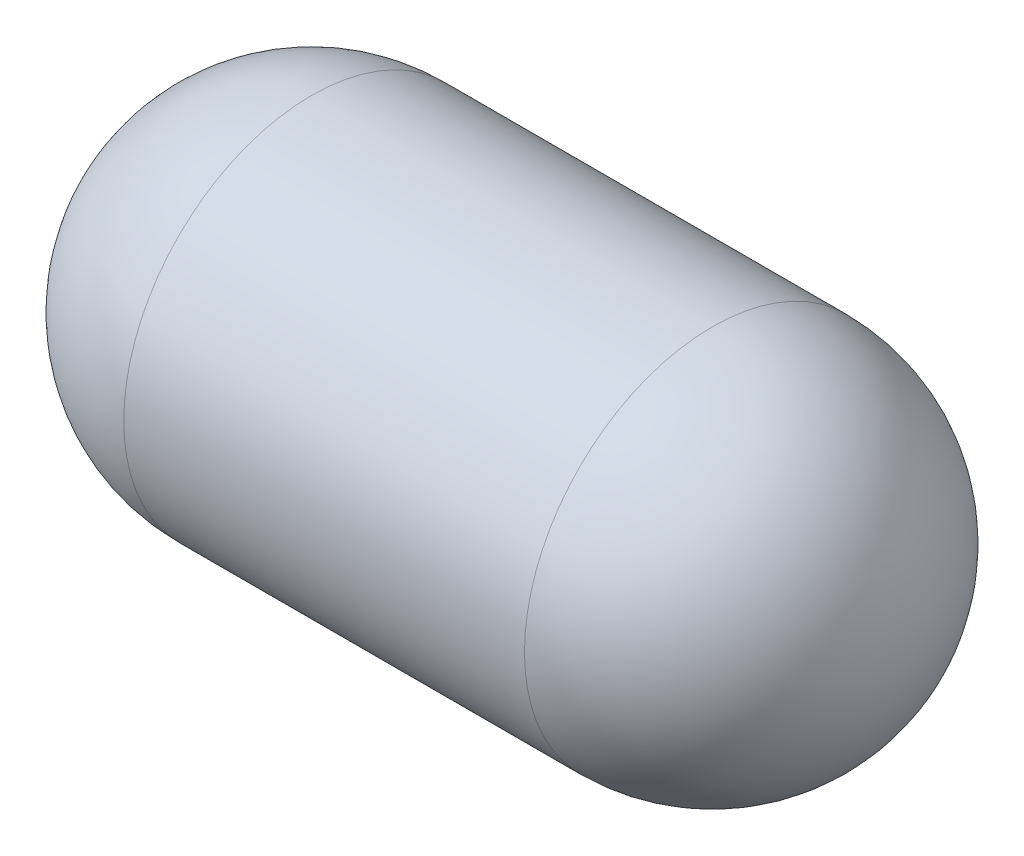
ISO-10303-21;
HEADER;
FILE_DESCRIPTION(('STEP AP214'),'2;1');
FILE_NAME('part.step','',(''),(''),'','','');
FILE_SCHEMA(('AUTOMOTIVE_DESIGN { 1 0 10303 214 1 1 1 1 }'));
ENDSEC;
DATA;
#1=APPLICATION_CONTEXT('core data for automotive mechanical design processes');
#2=APPLICATION_PROTOCOL_DEFINITION('international standard','automotive_design',2000,#1);
#3=PRODUCT_CONTEXT('',#1,'mechanical');
#4=PRODUCT('Part','Part','',(#3));
#5=PRODUCT_RELATED_PRODUCT_CATEGORY('part','',(#4));
#6=PRODUCT_DEFINITION_FORMATION('','',#4);
#7=PRODUCT_DEFINITION_CONTEXT('part definition',#1,'design');
#8=PRODUCT_DEFINITION('design','',#6,#7);
#9=PRODUCT_DEFINITION_SHAPE('','',#8);
#10=(LENGTH_UNIT() NAMED_UNIT(*) SI_UNIT(.MILLI.,.METRE.));
#11=(NAMED_UNIT(*) PLANE_ANGLE_UNIT() SI_UNIT($,.RADIAN.));
#12=(NAMED_UNIT(*) SI_UNIT($,.STERADIAN.) SOLID_ANGLE_UNIT());
#13=UNCERTAINTY_MEASURE_WITH_UNIT(LENGTH_MEASURE(1.E-05),#10,'distance_accuracy_value','');
#14=(GEOMETRIC_REPRESENTATION_CONTEXT(3) GLOBAL_UNCERTAINTY_ASSIGNED_CONTEXT((#13)) GLOBAL_UNIT_ASSIGNED_CONTEXT((#10,
#11,#12)) REPRESENTATION_CONTEXT('',''));
#15=CARTESIAN_POINT('',(0.,0.,0.));
#16=DIRECTION('',(0.,0.,1.));
#17=DIRECTION('',(1.,0.,0.));
#18=AXIS2_PLACEMENT_3D('',#15,#16,#17);
#19=CARTESIAN_POINT('',(80.,0.,0.));
#20=DIRECTION('',(-1.,0.,0.));
#21=DIRECTION('',(0.,1.,0.));
#22=AXIS2_PLACEMENT_3D('',#19,#20,#21);
#23=SPHERICAL_SURFACE('',#22,75.);
#24=CARTESIAN_POINT('',(80.,0.,0.));
#25=DIRECTION('',(-1.,0.,0.));
#26=DIRECTION('',(0.,0.,1.));
#27=AXIS2_PLACEMENT_3D('',#24,#25,#26);
#28=CIRCLE('',#27,75.);
#29=CARTESIAN_POINT('',(80.,0.,75.));
#30=VERTEX_POINT('',#29);
#31=EDGE_CURVE('E10',#30,#30,#28,.T.);
#32=ORIENTED_EDGE('',*,*,#31,.F.);
#33=EDGE_LOOP('',(#32));
#34=FACE_BOUND('',#33,.T.);
#35=ADVANCED_FACE('F32',(#34),#23,.T.);
#36=CARTESIAN_POINT('',(-138.147777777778,0.,0.));
#37=DIRECTION('',(-1.,0.,0.));
#38=DIRECTION('',(0.,0.,1.));
#39=AXIS2_PLACEMENT_3D('',#36,#37,#38);
#40=CYLINDRICAL_SURFACE('',#39,75.);
#41=ORIENTED_EDGE('',*,*,#31,.T.);
#42=EDGE_LOOP('',(#41));
#43=FACE_BOUND('',#42,.T.);
#44=CARTESIAN_POINT('',(-80.,0.,0.));
#45=DIRECTION('',(-1.,0.,0.));
#46=DIRECTION('',(0.,0.,1.));
#47=AXIS2_PLACEMENT_3D('',#44,#45,#46);
#48=CIRCLE('',#47,75.);
#49=CARTESIAN_POINT('',(-80.,0.,75.));
#50=VERTEX_POINT('',#49);
#51=EDGE_CURVE('E40',#50,#50,#48,.T.);
#52=ORIENTED_EDGE('',*,*,#51,.F.);
#53=EDGE_LOOP('',(#52));
#54=FACE_BOUND('',#53,.T.);
#55=ADVANCED_FACE('F72',(#43,#54),#40,.T.);
#56=CARTESIAN_POINT('',(-80.,0.,0.));
#57=DIRECTION('',(-1.,0.,0.));
#58=DIRECTION('',(0.,1.,0.));
#59=AXIS2_PLACEMENT_3D('',#56,#57,#58);
#60=SPHERICAL_SURFACE('',#59,75.);
#61=ORIENTED_EDGE('',*,*,#51,.T.);
#62=EDGE_LOOP('',(#61));
#63=FACE_BOUND('',#62,.T.);
#64=ADVANCED_FACE('F69',(#63),#60,.T.);
#65=CLOSED_SHELL('',(#35,#55,#64));
#66=CARTESIAN_POINT('',(80.,0.,0.));
#67=DIRECTION('',(-1.,0.,0.));
#68=DIRECTION('',(0.,1.,0.));
#69=AXIS2_PLACEMENT_3D('',#66,#67,#68);
#70=SPHERICAL_SURFACE('',#69,72.);
#71=CARTESIAN_POINT('',(80.,0.,0.));
#72=DIRECTION('',(-1.,0.,0.));
#73=DIRECTION('',(0.,0.,1.));
#74=AXIS2_PLACEMENT_3D('',#71,#72,#73);
#75=CIRCLE('',#74,72.);
#76=CARTESIAN_POINT('',(80.,0.,72.));
#77=VERTEX_POINT('',#76);
#78=EDGE_CURVE('E48',#77,#77,#75,.T.);
#79=ORIENTED_EDGE('',*,*,#78,.T.);
#80=EDGE_LOOP('',(#79));
#81=FACE_BOUND('',#80,.T.);
#82=ADVANCED_FACE('F34',(#81),#70,.F.);
#83=CARTESIAN_POINT('',(-80.,0.,0.));
#84=DIRECTION('',(-1.,0.,0.));
#85=DIRECTION('',(0.,1.,0.));
#86=AXIS2_PLACEMENT_3D('',#83,#84,#85);
#87=SPHERICAL_SURFACE('',#86,72.);
#88=CARTESIAN_POINT('',(-80.,0.,0.));
#89=DIRECTION('',(-1.,0.,0.));
#90=DIRECTION('',(0.,0.,1.));
#91=AXIS2_PLACEMENT_3D('',#88,#89,#90);
#92=CIRCLE('',#91,72.);
#93=CARTESIAN_POINT('',(-80.,0.,72.));
#94=VERTEX_POINT('',#93);
#95=EDGE_CURVE('E44',#94,#94,#92,.T.);
#96=ORIENTED_EDGE('',*,*,#95,.F.);
#97=EDGE_LOOP('',(#96));
#98=FACE_BOUND('',#97,.T.);
#99=ADVANCED_FACE('F58',(#98),#87,.F.);
#100=CARTESIAN_POINT('',(-138.147777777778,0.,0.));
#101=DIRECTION('',(-1.,0.,0.));
#102=DIRECTION('',(0.,0.,1.));
#103=AXIS2_PLACEMENT_3D('',#100,#101,#102);
#104=CYLINDRICAL_SURFACE('',#103,72.);
#105=ORIENTED_EDGE('',*,*,#78,.F.);
#106=EDGE_LOOP('',(#105));
#107=FACE_BOUND('',#106,.T.);
#108=ORIENTED_EDGE('',*,*,#95,.T.);
#109=EDGE_LOOP('',(#108));
#110=FACE_BOUND('',#109,.T.);
#111=ADVANCED_FACE('F55',(#107,#110),#104,.F.);
#112=CLOSED_SHELL('',(#82,#99,#111));
#113=ORIENTED_CLOSED_SHELL('',*,#112,.T.);
#114=BREP_WITH_VOIDS('B2',#65,(#113));
#115=ADVANCED_BREP_SHAPE_REPRESENTATION('',(#18,#114),#14);
#116=SHAPE_DEFINITION_REPRESENTATION(#9,#115);
ENDSEC;
END-ISO-10303-21;
